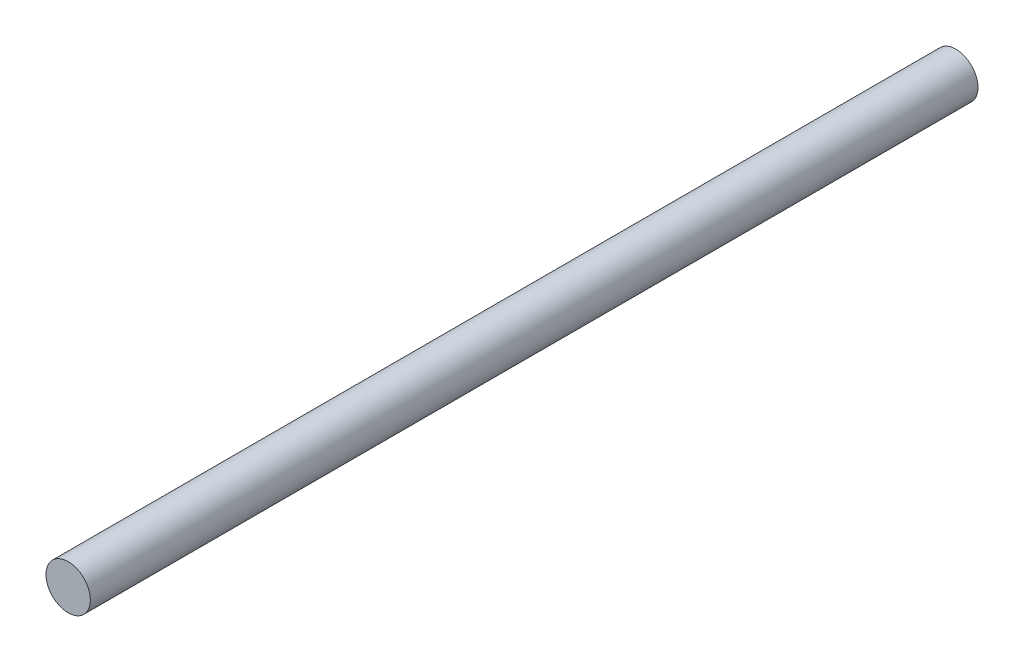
from build123d import *

# Parameters (mm, degrees)
SKETCH1_R           = 4
BOSS_EXTRUDE1_DEPTH = 160


with BuildPart() as part:
    # Sketch1 → Boss-Extrude1 (new body)
    with BuildSketch(Plane.XY):
        Circle(SKETCH1_R)
    extrude(amount=BOSS_EXTRUDE1_DEPTH)


solid = part.part
